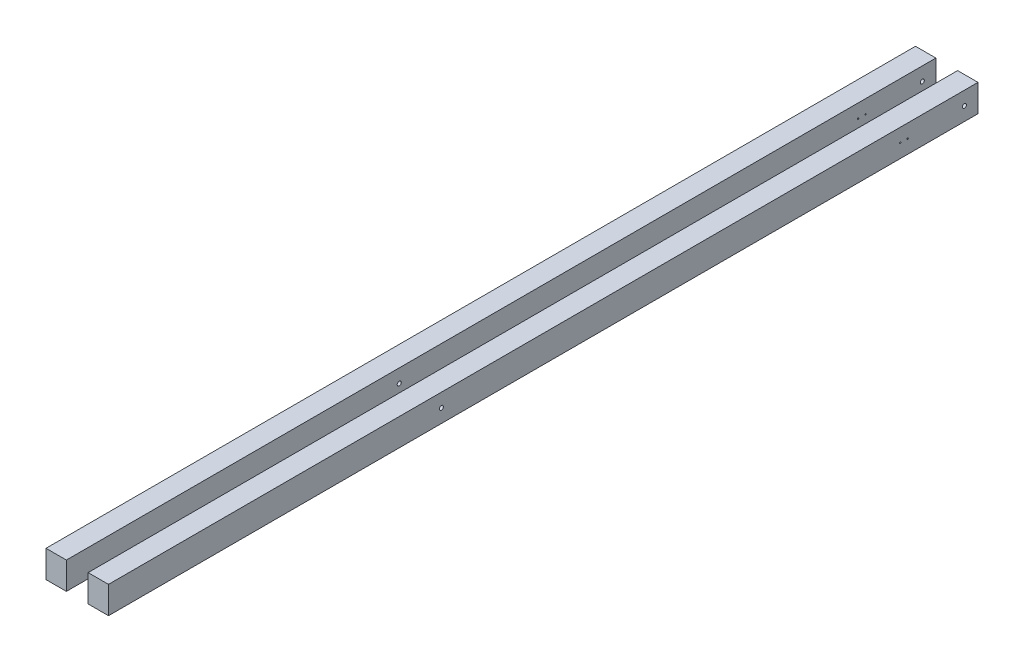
from build123d import *

# Parameters (mm, degrees)
ESQUISSE1_W                  = 30
ESQUISSE1_H                  = 40
BOSS_EXTRU_1_DEPTH           = 1280
BOSS_EXTRU_1_2_DEPTH         = 1280
ENL_V_MAT_EXTRU_1_DEPTH      = 1281.982435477
ENL_V_MAT_EXTRU_1_DEPTH_BACK = 1281.982435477
ESQUISSE2_R                  = 3
ESQUISSE2_R_2                = 1


with BuildPart() as part:
    # Esquisse1 → Boss.-Extru.1 (new body)
    with BuildSketch(Plane.XY):
        with Locations((31, 0)):
            Rectangle(ESQUISSE1_W, ESQUISSE1_H)
    extrude(amount=BOSS_EXTRU_1_DEPTH)


with BuildPart() as body_2:
    # Esquisse1 → Boss.-Extru.1 2 (new body)
    with BuildSketch(Plane.XY):
        with Locations((-31, 0)):
            Rectangle(ESQUISSE1_W, ESQUISSE1_H)
    extrude(amount=BOSS_EXTRU_1_2_DEPTH)


with BuildPart() as enl_v_mat_extru_1_tool:
    # Esquisse2 → Enl_v. mat.-Extru.1 (new, two sides: drawn at the far end of the back side and taken through both)
    with BuildSketch(Plane(origin=(0, 0, 0), x_dir=(0, 0, -1), z_dir=(1, 0, 0)).offset(-ENL_V_MAT_EXTRU_1_DEPTH_BACK)):
        with Locations((-790, 0)):
            Circle(ESQUISSE2_R)
        with Locations((-20, 0)):
            Circle(ESQUISSE2_R)
        with Locations((-114.397647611, 0)):
            Circle(ESQUISSE2_R_2)
        with Locations((-103.59217341, 0)):
            Circle(ESQUISSE2_R_2)
    extrude(amount=ENL_V_MAT_EXTRU_1_DEPTH + ENL_V_MAT_EXTRU_1_DEPTH_BACK)


with BuildPart() as part_1:
    add(part.part)

    # Enl_v. mat.-Extru.1: cut by enl_v_mat_extru_1_tool
    add(enl_v_mat_extru_1_tool.part, mode=Mode.SUBTRACT)


with BuildPart() as body_2_1:
    add(body_2.part)

    # Enl_v. mat.-Extru.1: cut by enl_v_mat_extru_1_tool
    add(enl_v_mat_extru_1_tool.part, mode=Mode.SUBTRACT)


solid = Compound([part_1.part, body_2_1.part])
